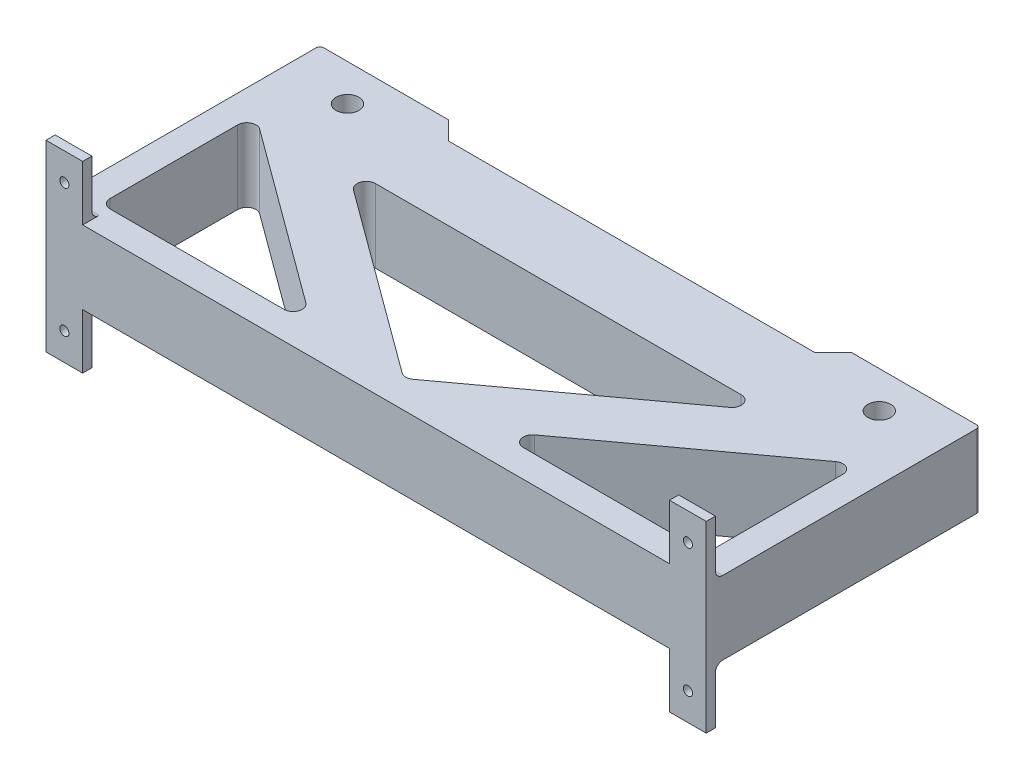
from build123d import *

# Parameters (mm, degrees)
SKETCH1_R           = 7.9375
BOSS_EXTRUDE1_DEPTH = 50.8
FILLET3_R           = 6.35
SKETCH2_W           = 82.55
SKETCH2_H           = 28.1432
CUT_EXTRUDE1_DEPTH  = 63.5
SKETCH3_W           = 6.35
SKETCH3_H           = 38.1
BOSS_EXTRUDE2_DEPTH = 25.4
SKETCH4_W           = 6.35
SKETCH4_H           = 38.1
BOSS_EXTRUDE3_DEPTH = 25.4
FILLET4_R           = 5.08
SKETCH5_R           = 3.175
CUT_EXTRUDE2_DEPTH  = 94.8436
FILLET2_R           = 2.54


with BuildPart() as part:
    # Sketch1 → Boss-Extrude1 (new body)
    with BuildSketch(Plane(origin=(0, 0, 0), x_dir=(1, 0, 0), z_dir=(0, 1, 0))):
        Polygon((-139.7, 94.8436), (-127, 82.1436), (127, 82.1436), (139.7, 94.8436), (228.6, 94.8436), (228.6, -94.8436), (-228.6, -94.8436), (-228.6, 94.8436), align=None)
        with Locations(Location((-184.15, 69.4436, 0), (0, 0, 270))):
            Circle(SKETCH1_R, mode=Mode.SUBTRACT)
        with Locations(Location((184.15, 69.4436, 0), (0, 0, 270))):
            Circle(SKETCH1_R, mode=Mode.SUBTRACT)
        Polygon((146.05, 31.3436), (-146.05, 31.3436), (0, -75.7936), align=None, mode=Mode.SUBTRACT)
        Polygon((-209.55, 31.3436), (-209.55, -75.7936), (-63.5, -75.7936), align=None, mode=Mode.SUBTRACT)
        Polygon((209.55, -75.7936), (63.5, -75.7936), (209.55, 31.3436), align=None, mode=Mode.SUBTRACT)
    extrude(amount=BOSS_EXTRUDE1_DEPTH)

    # Fillet3
    fillet3_edges = [part.edges().sort_by_distance(p)[0] for p in [
        (-146.05, 25.4, -31.3436),
        (0, 25.4, 75.7936),
        (146.05, 25.4, -31.3436),
        (-63.5, 25.4, 75.7936),
        (-209.55, 25.4, -31.3436),
        (-209.55, 25.4, 75.7936),
        (209.55, 25.4, 75.7936),
        (209.55, 25.4, -31.3436),
        (63.5, 25.4, 75.7936),
    ]]
    fillet(fillet3_edges, radius=FILLET3_R)

    # Sketch2 → Cut-Extrude1 (cut)
    with BuildSketch(Plane(origin=(0, 0, -94.8436), x_dir=(-1, 0, 0), z_dir=(0, 0, -1))):
        with Locations((184.15, 25.4)):
            Rectangle(SKETCH2_W, SKETCH2_H)
        with Locations((-184.15, 25.4)):
            Rectangle(SKETCH2_W, SKETCH2_H)
    extrude(amount=-CUT_EXTRUDE1_DEPTH, mode=Mode.SUBTRACT)

    # Sketch3 → Boss-Extrude2 (add)
    with BuildSketch(Plane(origin=(228.6, 0, 0), x_dir=(0, 0, -1), z_dir=(1, 0, 0))):
        with Locations((-91.6686, 69.85)):
            Rectangle(SKETCH3_W, SKETCH3_H)
        with Locations((-91.6686, -19.05)):
            Rectangle(SKETCH3_W, SKETCH3_H)
    extrude(amount=-BOSS_EXTRUDE2_DEPTH)

    # Sketch4 → Boss-Extrude3 (add)
    with BuildSketch(Plane.ZY.offset(228.6)):
        with Locations((91.6686, 69.85)):
            Rectangle(SKETCH4_W, SKETCH4_H)
        with Locations((91.6686, -19.05)):
            Rectangle(SKETCH4_W, SKETCH4_H)
    extrude(amount=-BOSS_EXTRUDE3_DEPTH)

    # Fillet4
    fillet4_edges = [part.edges().sort_by_distance(p)[0] for p in [
        (215.9, 50.8, 88.4936),
        (215.9, 0, 88.4936),
        (-215.9, 50.8, 88.4936),
        (-215.9, 0, 88.4936),
    ]]
    fillet(fillet4_edges, radius=FILLET4_R)

    # Sketch5 → Cut-Extrude2 (cut)
    with BuildSketch(Plane.XY):
        with Locations(Location((-215.9, 69.85, 0), (0, 0, 180))):
            Circle(SKETCH5_R)
        with Locations(Location((215.9, 69.85, 0), (0, 0, 180))):
            Circle(SKETCH5_R)
        with Locations(Location((-215.9, -19.05, 0), (0, 0, 180))):
            Circle(SKETCH5_R)
        with Locations(Location((215.9, -19.05, 0), (0, 0, 180))):
            Circle(SKETCH5_R)
    extrude(amount=CUT_EXTRUDE2_DEPTH, mode=Mode.SUBTRACT)

    # Fillet2
    fillet2_edges = [part.edges().sort_by_distance(p)[0] for p in [
        (228.6, 25.4, -94.8436),
        (-228.6, 25.4, -94.8436),
    ]]
    fillet(fillet2_edges, radius=FILLET2_R)


solid = part.part
